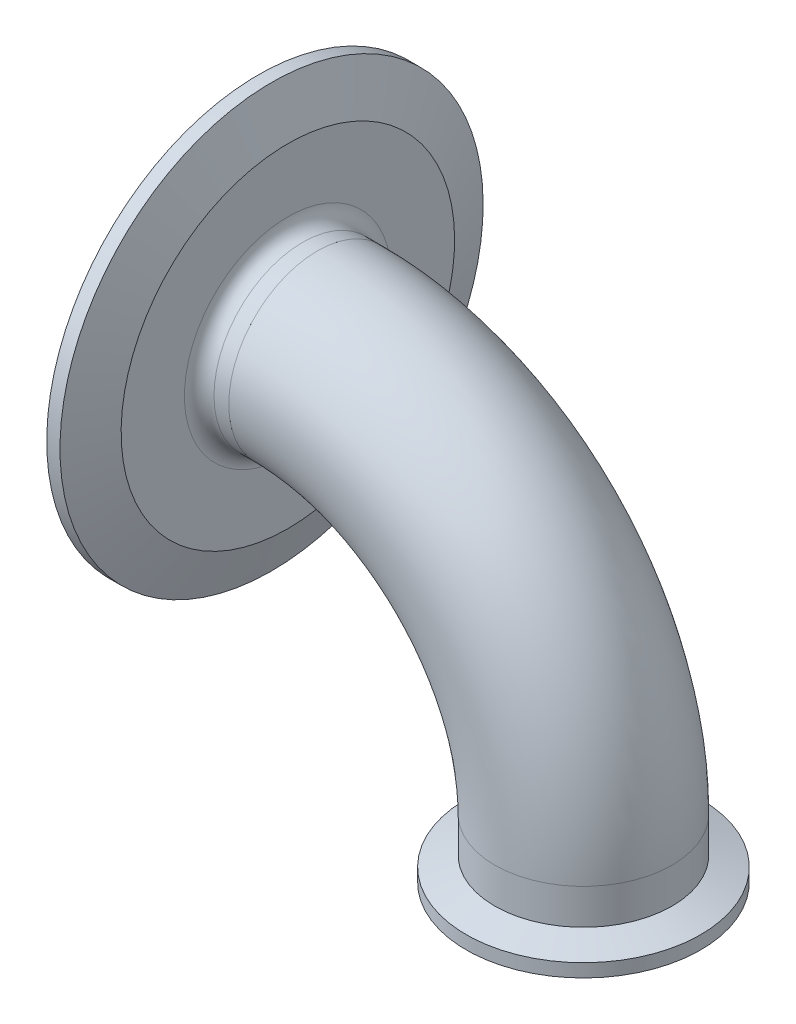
ISO-10303-21;
HEADER;
FILE_DESCRIPTION(('STEP AP214'),'2;1');
FILE_NAME('part.step','',(''),(''),'','','');
FILE_SCHEMA(('AUTOMOTIVE_DESIGN { 1 0 10303 214 1 1 1 1 }'));
ENDSEC;
DATA;
#1=APPLICATION_CONTEXT('core data for automotive mechanical design processes');
#2=APPLICATION_PROTOCOL_DEFINITION('international standard','automotive_design',2000,#1);
#3=PRODUCT_CONTEXT('',#1,'mechanical');
#4=PRODUCT('Part','Part','',(#3));
#5=PRODUCT_RELATED_PRODUCT_CATEGORY('part','',(#4));
#6=PRODUCT_DEFINITION_FORMATION('','',#4);
#7=PRODUCT_DEFINITION_CONTEXT('part definition',#1,'design');
#8=PRODUCT_DEFINITION('design','',#6,#7);
#9=PRODUCT_DEFINITION_SHAPE('','',#8);
#10=(LENGTH_UNIT() NAMED_UNIT(*) SI_UNIT(.MILLI.,.METRE.));
#11=(NAMED_UNIT(*) PLANE_ANGLE_UNIT() SI_UNIT($,.RADIAN.));
#12=(NAMED_UNIT(*) SI_UNIT($,.STERADIAN.) SOLID_ANGLE_UNIT());
#13=UNCERTAINTY_MEASURE_WITH_UNIT(LENGTH_MEASURE(1.E-05),#10,'distance_accuracy_value','');
#14=(GEOMETRIC_REPRESENTATION_CONTEXT(3) GLOBAL_UNCERTAINTY_ASSIGNED_CONTEXT((#13)) GLOBAL_UNIT_ASSIGNED_CONTEXT((#10,
#11,#12)) REPRESENTATION_CONTEXT('',''));
#15=CARTESIAN_POINT('',(0.,0.,0.));
#16=DIRECTION('',(0.,0.,1.));
#17=DIRECTION('',(1.,0.,0.));
#18=AXIS2_PLACEMENT_3D('',#15,#16,#17);
#19=CARTESIAN_POINT('',(59.5093319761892,14.6557046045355,81.3536655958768));
#20=DIRECTION('',(0.,1.00000000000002,0.));
#21=DIRECTION('',(0.,0.,1.00000000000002));
#22=AXIS2_PLACEMENT_3D('',#19,#20,#21);
#23=CONICAL_SURFACE('',#22,20.9336326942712,0.401425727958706);
#24=CARTESIAN_POINT('',(59.5093319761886,14.1359685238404,81.3536655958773));
#25=DIRECTION('',(0.,-1.00000000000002,0.));
#26=DIRECTION('',(0.,0.,-1.00000000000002));
#27=AXIS2_PLACEMENT_3D('',#24,#25,#26);
#28=CIRCLE('',#27,20.7130178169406);
#29=CARTESIAN_POINT('',(59.5093319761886,14.1359685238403,60.6406477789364));
#30=VERTEX_POINT('',#29);
#31=EDGE_CURVE('P0_E9',#30,#30,#28,.T.);
#32=ORIENTED_EDGE('',*,*,#31,.F.);
#33=EDGE_LOOP('',(#32));
#34=FACE_BOUND('',#33,.T.);
#35=CARTESIAN_POINT('',(59.5093319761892,14.6557046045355,81.3536655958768));
#36=DIRECTION('',(0.,-1.00000000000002,0.));
#37=DIRECTION('',(0.,0.,-1.00000000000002));
#38=AXIS2_PLACEMENT_3D('',#35,#36,#37);
#39=CIRCLE('',#38,20.9336326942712);
#40=CARTESIAN_POINT('',(59.5093319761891,14.6557046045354,60.4200329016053));
#41=VERTEX_POINT('',#40);
#42=EDGE_CURVE('P0_E54',#41,#41,#39,.T.);
#43=ORIENTED_EDGE('',*,*,#42,.T.);
#44=EDGE_LOOP('',(#43));
#45=FACE_BOUND('',#44,.T.);
#46=ADVANCED_FACE('P0_F14',(#34,#45),#23,.T.);
#47=CARTESIAN_POINT('',(59.5093319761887,14.4337056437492,81.3536655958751));
#48=DIRECTION('',(0.,-1.00000000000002,0.));
#49=DIRECTION('',(0.,0.,-1.00000000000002));
#50=AXIS2_PLACEMENT_3D('',#47,#48,#49);
#51=TOROIDAL_SURFACE('',#50,20.0115931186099,0.761999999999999);
#52=CARTESIAN_POINT('',(59.5093319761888,13.6717056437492,81.3536655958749));
#53=DIRECTION('',(0.,-1.00000000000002,0.));
#54=DIRECTION('',(0.,0.,-1.00000000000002));
#55=AXIS2_PLACEMENT_3D('',#52,#53,#54);
#56=CIRCLE('',#55,20.0115931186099);
#57=CARTESIAN_POINT('',(59.5093319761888,13.6717056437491,61.3420724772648));
#58=VERTEX_POINT('',#57);
#59=EDGE_CURVE('P0_E20',#58,#58,#56,.T.);
#60=ORIENTED_EDGE('',*,*,#59,.F.);
#61=EDGE_LOOP('',(#60));
#62=FACE_BOUND('',#61,.T.);
#63=ORIENTED_EDGE('',*,*,#31,.T.);
#64=EDGE_LOOP('',(#63));
#65=FACE_BOUND('',#64,.T.);
#66=ADVANCED_FACE('P0_F84',(#62,#65),#51,.T.);
#67=CARTESIAN_POINT('',(59.5093319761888,13.6717056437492,81.3536655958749));
#68=DIRECTION('',(0.,1.00000000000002,0.));
#69=DIRECTION('',(0.,0.,1.00000000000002));
#70=AXIS2_PLACEMENT_3D('',#67,#68,#69);
#71=PLANE('',#70);
#72=CARTESIAN_POINT('',(59.5093319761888,13.6717056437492,81.3536655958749));
#73=DIRECTION('',(0.,-1.00000000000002,0.));
#74=DIRECTION('',(0.,0.,-1.00000000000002));
#75=AXIS2_PLACEMENT_3D('',#72,#73,#74);
#76=CIRCLE('',#75,17.399);
#77=CARTESIAN_POINT('',(59.5093319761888,13.6717056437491,63.9546655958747));
#78=VERTEX_POINT('',#77);
#79=EDGE_CURVE('P0_E24',#78,#78,#76,.T.);
#80=ORIENTED_EDGE('',*,*,#79,.F.);
#81=EDGE_LOOP('',(#80));
#82=FACE_BOUND('',#81,.T.);
#83=ORIENTED_EDGE('',*,*,#59,.T.);
#84=EDGE_LOOP('',(#83));
#85=FACE_BOUND('',#84,.T.);
#86=ADVANCED_FACE('P0_F89',(#82,#85),#71,.F.);
#87=CARTESIAN_POINT('',(59.5093319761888,13.6717056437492,81.3536655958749));
#88=DIRECTION('',(0.,-1.00000000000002,0.));
#89=DIRECTION('',(0.,0.,-1.00000000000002));
#90=AXIS2_PLACEMENT_3D('',#87,#88,#89);
#91=CYLINDRICAL_SURFACE('',#90,17.399);
#92=ORIENTED_EDGE('',*,*,#79,.T.);
#93=EDGE_LOOP('',(#92));
#94=FACE_BOUND('',#93,.T.);
#95=CARTESIAN_POINT('',(59.5093319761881,26.3717056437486,81.3536655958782));
#96=DIRECTION('',(0.,-1.00000000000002,0.));
#97=DIRECTION('',(0.,0.,-1.00000000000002));
#98=AXIS2_PLACEMENT_3D('',#95,#96,#97);
#99=CIRCLE('',#98,17.399);
#100=CARTESIAN_POINT('',(59.5093319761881,26.3717056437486,63.954665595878));
#101=VERTEX_POINT('',#100);
#102=EDGE_CURVE('P0_E28',#101,#101,#99,.T.);
#103=ORIENTED_EDGE('',*,*,#102,.F.);
#104=EDGE_LOOP('',(#103));
#105=FACE_BOUND('',#104,.T.);
#106=ADVANCED_FACE('P0_F94',(#94,#105),#91,.F.);
#107=CARTESIAN_POINT('',(59.5093319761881,26.3717056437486,81.3536655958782));
#108=DIRECTION('',(0.,-1.00000000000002,0.));
#109=DIRECTION('',(0.,0.,-1.00000000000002));
#110=AXIS2_PLACEMENT_3D('',#107,#108,#109);
#111=PLANE('',#110);
#112=CARTESIAN_POINT('',(59.5093319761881,26.3717056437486,81.3536655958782));
#113=DIRECTION('',(0.,-1.00000000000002,0.));
#114=DIRECTION('',(0.,0.,-1.00000000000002));
#115=AXIS2_PLACEMENT_3D('',#112,#113,#114);
#116=CIRCLE('',#115,19.05);
#117=CARTESIAN_POINT('',(59.5093319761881,26.3717056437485,62.3036655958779));
#118=VERTEX_POINT('',#117);
#119=EDGE_CURVE('P0_E33',#118,#118,#116,.T.);
#120=ORIENTED_EDGE('',*,*,#119,.F.);
#121=EDGE_LOOP('',(#120));
#122=FACE_BOUND('',#121,.T.);
#123=ORIENTED_EDGE('',*,*,#102,.T.);
#124=EDGE_LOOP('',(#123));
#125=FACE_BOUND('',#124,.T.);
#126=ADVANCED_FACE('P0_F100',(#122,#125),#111,.F.);
#127=CARTESIAN_POINT('',(59.5093319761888,13.6717056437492,81.3536655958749));
#128=DIRECTION('',(0.,-1.00000000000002,0.));
#129=DIRECTION('',(0.,0.,-1.00000000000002));
#130=AXIS2_PLACEMENT_3D('',#127,#128,#129);
#131=CYLINDRICAL_SURFACE('',#130,19.05);
#132=CARTESIAN_POINT('',(59.5093319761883,18.7537578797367,81.3536655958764));
#133=DIRECTION('',(0.,-1.00000000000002,0.));
#134=DIRECTION('',(0.,0.,-1.00000000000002));
#135=AXIS2_PLACEMENT_3D('',#132,#133,#134);
#136=CIRCLE('',#135,19.05);
#137=CARTESIAN_POINT('',(59.5093319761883,18.7537578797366,62.3036655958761));
#138=VERTEX_POINT('',#137);
#139=EDGE_CURVE('P0_E36',#138,#138,#136,.T.);
#140=ORIENTED_EDGE('',*,*,#139,.F.);
#141=EDGE_LOOP('',(#140));
#142=FACE_BOUND('',#141,.T.);
#143=ORIENTED_EDGE('',*,*,#119,.T.);
#144=EDGE_LOOP('',(#143));
#145=FACE_BOUND('',#144,.T.);
#146=ADVANCED_FACE('P0_F104',(#142,#145),#131,.T.);
#147=CARTESIAN_POINT('',(59.5093319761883,18.7537578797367,81.3536655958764));
#148=DIRECTION('',(0.,-1.00000000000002,0.));
#149=DIRECTION('',(0.,0.,-1.00000000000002));
#150=AXIS2_PLACEMENT_3D('',#147,#148,#149);
#151=CONICAL_SURFACE('',#150,19.05,1.22173047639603);
#152=CARTESIAN_POINT('',(59.5093319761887,16.5165056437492,81.3536655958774));
#153=DIRECTION('',(0.,-1.00000000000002,0.));
#154=DIRECTION('',(0.,0.,-1.00000000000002));
#155=AXIS2_PLACEMENT_3D('',#152,#153,#154);
#156=CIRCLE('',#155,25.1968);
#157=CARTESIAN_POINT('',(59.5093319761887,16.5165056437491,56.156865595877));
#158=VERTEX_POINT('',#157);
#159=EDGE_CURVE('P0_E39',#158,#158,#156,.T.);
#160=ORIENTED_EDGE('',*,*,#159,.F.);
#161=EDGE_LOOP('',(#160));
#162=FACE_BOUND('',#161,.T.);
#163=ORIENTED_EDGE('',*,*,#139,.T.);
#164=EDGE_LOOP('',(#163));
#165=FACE_BOUND('',#164,.T.);
#166=ADVANCED_FACE('P0_F108',(#162,#165),#151,.T.);
#167=CARTESIAN_POINT('',(59.5093319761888,13.6717056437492,81.3536655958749));
#168=DIRECTION('',(0.,-1.00000000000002,0.));
#169=DIRECTION('',(0.,0.,-1.00000000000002));
#170=AXIS2_PLACEMENT_3D('',#167,#168,#169);
#171=CYLINDRICAL_SURFACE('',#170,25.1968);
#172=CARTESIAN_POINT('',(59.5093319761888,13.6717056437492,81.3536655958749));
#173=DIRECTION('',(0.,-1.00000000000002,0.));
#174=DIRECTION('',(0.,0.,-1.00000000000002));
#175=AXIS2_PLACEMENT_3D('',#172,#173,#174);
#176=CIRCLE('',#175,25.1968);
#177=CARTESIAN_POINT('',(59.5093319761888,13.6717056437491,56.1568655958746));
#178=VERTEX_POINT('',#177);
#179=EDGE_CURVE('P0_E42',#178,#178,#176,.T.);
#180=ORIENTED_EDGE('',*,*,#179,.F.);
#181=EDGE_LOOP('',(#180));
#182=FACE_BOUND('',#181,.T.);
#183=ORIENTED_EDGE('',*,*,#159,.T.);
#184=EDGE_LOOP('',(#183));
#185=FACE_BOUND('',#184,.T.);
#186=ADVANCED_FACE('P0_F80',(#182,#185),#171,.T.);
#187=CARTESIAN_POINT('',(59.5093319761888,13.6717056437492,81.3536655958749));
#188=DIRECTION('',(0.,1.00000000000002,0.));
#189=DIRECTION('',(0.,0.,1.00000000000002));
#190=AXIS2_PLACEMENT_3D('',#187,#188,#189);
#191=PLANE('',#190);
#192=CARTESIAN_POINT('',(59.5093319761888,13.6717056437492,81.3536655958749));
#193=DIRECTION('',(0.,-1.00000000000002,0.));
#194=DIRECTION('',(0.,0.,-1.00000000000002));
#195=AXIS2_PLACEMENT_3D('',#192,#193,#194);
#196=CIRCLE('',#195,23.9521599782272);
#197=CARTESIAN_POINT('',(59.5093319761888,13.6717056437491,57.4015056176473));
#198=VERTEX_POINT('',#197);
#199=EDGE_CURVE('P0_E45',#198,#198,#196,.T.);
#200=ORIENTED_EDGE('',*,*,#199,.F.);
#201=EDGE_LOOP('',(#200));
#202=FACE_BOUND('',#201,.T.);
#203=ORIENTED_EDGE('',*,*,#179,.T.);
#204=EDGE_LOOP('',(#203));
#205=FACE_BOUND('',#204,.T.);
#206=ADVANCED_FACE('P0_F73',(#202,#205),#191,.F.);
#207=CARTESIAN_POINT('',(59.5093319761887,14.4337056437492,81.3536655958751));
#208=DIRECTION('',(0.,-1.00000000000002,0.));
#209=DIRECTION('',(0.,0.,-1.00000000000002));
#210=AXIS2_PLACEMENT_3D('',#207,#208,#209);
#211=TOROIDAL_SURFACE('',#210,23.9521599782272,0.761999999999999);
#212=ORIENTED_EDGE('',*,*,#199,.T.);
#213=EDGE_LOOP('',(#212));
#214=FACE_BOUND('',#213,.T.);
#215=CARTESIAN_POINT('',(59.5093319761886,14.1359685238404,81.3536655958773));
#216=DIRECTION('',(0.,-1.00000000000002,0.));
#217=DIRECTION('',(0.,0.,-1.00000000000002));
#218=AXIS2_PLACEMENT_3D('',#215,#216,#217);
#219=CIRCLE('',#218,23.2507352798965);
#220=CARTESIAN_POINT('',(59.5093319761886,14.1359685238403,58.1029303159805));
#221=VERTEX_POINT('',#220);
#222=EDGE_CURVE('P0_E48',#221,#221,#219,.T.);
#223=ORIENTED_EDGE('',*,*,#222,.F.);
#224=EDGE_LOOP('',(#223));
#225=FACE_BOUND('',#224,.T.);
#226=ADVANCED_FACE('P0_F68',(#214,#225),#211,.T.);
#227=CARTESIAN_POINT('',(59.5093319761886,14.1359685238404,81.3536655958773));
#228=DIRECTION('',(0.,-1.00000000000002,0.));
#229=DIRECTION('',(0.,0.,-1.00000000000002));
#230=AXIS2_PLACEMENT_3D('',#227,#228,#229);
#231=CONICAL_SURFACE('',#230,23.2507352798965,0.401425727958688);
#232=CARTESIAN_POINT('',(59.5093319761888,14.5445604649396,81.3536655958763));
#233=DIRECTION('',(0.,-1.00000000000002,0.));
#234=DIRECTION('',(0.,0.,-1.00000000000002));
#235=AXIS2_PLACEMENT_3D('',#232,#233,#234);
#236=CIRCLE('',#235,23.0772982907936);
#237=CARTESIAN_POINT('',(59.5093319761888,14.5445604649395,58.2763673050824));
#238=VERTEX_POINT('',#237);
#239=EDGE_CURVE('P0_E51',#238,#238,#236,.T.);
#240=ORIENTED_EDGE('',*,*,#239,.F.);
#241=EDGE_LOOP('',(#240));
#242=FACE_BOUND('',#241,.T.);
#243=ORIENTED_EDGE('',*,*,#222,.T.);
#244=EDGE_LOOP('',(#243));
#245=FACE_BOUND('',#244,.T.);
#246=ADVANCED_FACE('P0_F62',(#242,#245),#231,.F.);
#247=CARTESIAN_POINT('',(59.5093319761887,14.0781056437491,81.353665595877));
#248=DIRECTION('',(0.,-1.00000000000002,0.));
#249=DIRECTION('',(0.,0.,-1.00000000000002));
#250=AXIS2_PLACEMENT_3D('',#247,#248,#249);
#251=TOROIDAL_SURFACE('',#250,21.9783995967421,1.1938);
#252=ORIENTED_EDGE('',*,*,#42,.F.);
#253=EDGE_LOOP('',(#252));
#254=FACE_BOUND('',#253,.T.);
#255=ORIENTED_EDGE('',*,*,#239,.T.);
#256=EDGE_LOOP('',(#255));
#257=FACE_BOUND('',#256,.T.);
#258=ADVANCED_FACE('P0_F59',(#254,#257),#251,.F.);
#259=CLOSED_SHELL('',(#46,#66,#86,#106,#126,#146,#166,#186,#206,#226,#246,#258));
#260=MANIFOLD_SOLID_BREP('P0_B1',#259);
#261=CARTESIAN_POINT('',(2.35933197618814,26.37170564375,81.3536655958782));
#262=DIRECTION('',(0.,0.,-1.));
#263=DIRECTION('',(-1.,0.,0.));
#264=AXIS2_PLACEMENT_3D('',#261,#262,#263);
#265=TOROIDAL_SURFACE('',#264,57.15,19.05);
#266=CARTESIAN_POINT('',(2.359331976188,83.5217056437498,81.3536655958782));
#267=DIRECTION('',(-1.,0.,0.));
#268=DIRECTION('',(0.,0.,1.));
#269=AXIS2_PLACEMENT_3D('',#266,#267,#268);
#270=CIRCLE('',#269,19.05);
#271=CARTESIAN_POINT('',(2.35933197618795,102.57170564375,81.3536655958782));
#272=VERTEX_POINT('',#271);
#273=EDGE_CURVE('P1_E10',#272,#272,#270,.T.);
#274=CARTESIAN_POINT('',(59.5093319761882,26.3717056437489,81.3536655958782));
#275=DIRECTION('',(0.,1.,0.));
#276=DIRECTION('',(0.,0.,1.));
#277=AXIS2_PLACEMENT_3D('',#274,#275,#276);
#278=CIRCLE('',#277,19.05);
#279=CARTESIAN_POINT('',(78.5593319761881,26.3717056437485,81.3536655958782));
#280=VERTEX_POINT('',#279);
#281=EDGE_CURVE('P1_E21',#280,#280,#278,.T.);
#282=CARTESIAN_POINT('',(2.35933197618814,26.37170564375,81.3536655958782));
#283=DIRECTION('',(0.,0.,-1.));
#284=DIRECTION('',(-1.,0.,0.));
#285=AXIS2_PLACEMENT_3D('',#282,#283,#284);
#286=CIRCLE('',#285,76.2);
#287=EDGE_CURVE('',#272,#280,#286,.T.);
#288=ORIENTED_EDGE('',*,*,#273,.F.);
#289=ORIENTED_EDGE('',*,*,#281,.T.);
#290=ORIENTED_EDGE('',*,*,#287,.T.);
#291=ORIENTED_EDGE('',*,*,#287,.F.);
#292=EDGE_LOOP('',(#288,#290,#289,#291));
#293=FACE_BOUND('',#292,.T.);
#294=ADVANCED_FACE('P1_F15',(#293),#265,.T.);
#295=CARTESIAN_POINT('',(2.359331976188,83.5217056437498,81.3536655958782));
#296=DIRECTION('',(-1.,0.,0.));
#297=DIRECTION('',(0.,0.,1.));
#298=AXIS2_PLACEMENT_3D('',#295,#296,#297);
#299=PLANE('',#298);
#300=CARTESIAN_POINT('',(2.359331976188,83.5217056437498,81.3536655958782));
#301=DIRECTION('',(-1.,0.,0.));
#302=DIRECTION('',(0.,-1.,0.));
#303=AXIS2_PLACEMENT_3D('',#300,#301,#302);
#304=CIRCLE('',#303,17.399);
#305=CARTESIAN_POINT('',(2.35933197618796,100.92070564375,81.3536655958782));
#306=VERTEX_POINT('',#305);
#307=EDGE_CURVE('P1_E25',#306,#306,#304,.T.);
#308=ORIENTED_EDGE('',*,*,#307,.F.);
#309=EDGE_LOOP('',(#308));
#310=FACE_BOUND('',#309,.T.);
#311=ORIENTED_EDGE('',*,*,#273,.T.);
#312=EDGE_LOOP('',(#311));
#313=FACE_BOUND('',#312,.T.);
#314=ADVANCED_FACE('P1_F46',(#310,#313),#299,.T.);
#315=CARTESIAN_POINT('',(59.5093319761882,26.3717056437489,81.3536655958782));
#316=DIRECTION('',(0.,1.,0.));
#317=DIRECTION('',(0.,0.,1.));
#318=AXIS2_PLACEMENT_3D('',#315,#316,#317);
#319=PLANE('',#318);
#320=CARTESIAN_POINT('',(59.5093319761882,26.3717056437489,81.3536655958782));
#321=DIRECTION('',(0.,1.,0.));
#322=DIRECTION('',(0.,0.,1.));
#323=AXIS2_PLACEMENT_3D('',#320,#321,#322);
#324=CIRCLE('',#323,17.399);
#325=CARTESIAN_POINT('',(76.9083319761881,26.3717056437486,81.3536655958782));
#326=VERTEX_POINT('',#325);
#327=EDGE_CURVE('P1_E29',#326,#326,#324,.T.);
#328=ORIENTED_EDGE('',*,*,#327,.T.);
#329=EDGE_LOOP('',(#328));
#330=FACE_BOUND('',#329,.T.);
#331=ORIENTED_EDGE('',*,*,#281,.F.);
#332=EDGE_LOOP('',(#331));
#333=FACE_BOUND('',#332,.T.);
#334=ADVANCED_FACE('P1_F35',(#330,#333),#319,.F.);
#335=CARTESIAN_POINT('',(2.35933197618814,26.37170564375,81.3536655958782));
#336=DIRECTION('',(0.,0.,-1.));
#337=DIRECTION('',(-1.,0.,0.));
#338=AXIS2_PLACEMENT_3D('',#335,#336,#337);
#339=TOROIDAL_SURFACE('',#338,57.15,17.399);
#340=CARTESIAN_POINT('',(2.35933197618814,26.37170564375,81.3536655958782));
#341=DIRECTION('',(0.,0.,-1.));
#342=DIRECTION('',(-1.,0.,0.));
#343=AXIS2_PLACEMENT_3D('',#340,#341,#342);
#344=CIRCLE('',#343,74.549);
#345=EDGE_CURVE('',#306,#326,#344,.T.);
#346=ORIENTED_EDGE('',*,*,#307,.T.);
#347=ORIENTED_EDGE('',*,*,#327,.F.);
#348=ORIENTED_EDGE('',*,*,#345,.T.);
#349=ORIENTED_EDGE('',*,*,#345,.F.);
#350=EDGE_LOOP('',(#346,#348,#347,#349));
#351=FACE_BOUND('',#350,.T.);
#352=ADVANCED_FACE('P1_F38',(#351),#339,.F.);
#353=CLOSED_SHELL('',(#294,#314,#334,#352));
#354=MANIFOLD_SOLID_BREP('P1_B1',#353);
#355=CARTESIAN_POINT('',(2.359331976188,96.5105696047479,92.9301337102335));
#356=DIRECTION('',(-1.,0.,0.));
#357=DIRECTION('',(0.,0.665352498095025,-0.746529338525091));
#358=AXIS2_PLACEMENT_3D('',#355,#356,#357);
#359=PLANE('',#358);
#360=CARTESIAN_POINT('',(2.35933197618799,83.5217056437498,81.3536655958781));
#361=DIRECTION('',(-1.,0.,0.));
#362=DIRECTION('',(0.,0.665352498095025,-0.746529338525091));
#363=AXIS2_PLACEMENT_3D('',#360,#361,#362);
#364=CIRCLE('',#363,19.05);
#365=CARTESIAN_POINT('',(2.35933197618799,96.19667073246,67.1322816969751));
#366=VERTEX_POINT('',#365);
#367=EDGE_CURVE('P2_E10',#366,#366,#364,.T.);
#368=ORIENTED_EDGE('',*,*,#367,.F.);
#369=EDGE_LOOP('',(#368));
#370=FACE_BOUND('',#369,.T.);
#371=CARTESIAN_POINT('',(2.359331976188,83.5217056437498,81.3536655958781));
#372=DIRECTION('',(-1.,0.,0.));
#373=DIRECTION('',(0.,0.665352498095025,-0.746529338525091));
#374=AXIS2_PLACEMENT_3D('',#371,#372,#373);
#375=CIRCLE('',#374,17.399);
#376=CARTESIAN_POINT('',(2.359331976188,95.0981737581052,68.3648016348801));
#377=VERTEX_POINT('',#376);
#378=EDGE_CURVE('P2_E64',#377,#377,#375,.T.);
#379=ORIENTED_EDGE('',*,*,#378,.T.);
#380=EDGE_LOOP('',(#379));
#381=FACE_BOUND('',#380,.T.);
#382=ADVANCED_FACE('P2_F15',(#370,#381),#359,.F.);
#383=CARTESIAN_POINT('',(-10.340668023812,83.5217056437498,81.3536655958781));
#384=DIRECTION('',(-1.,0.,0.));
#385=DIRECTION('',(0.,0.665352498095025,-0.746529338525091));
#386=AXIS2_PLACEMENT_3D('',#383,#384,#385);
#387=CYLINDRICAL_SURFACE('',#386,19.05);
#388=CARTESIAN_POINT('',(-0.815668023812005,83.5217056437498,81.3536655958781));
#389=DIRECTION('',(-1.,0.,0.));
#390=DIRECTION('',(0.,0.665352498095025,-0.746529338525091));
#391=AXIS2_PLACEMENT_3D('',#388,#389,#390);
#392=CIRCLE('',#391,19.05);
#393=CARTESIAN_POINT('',(-0.815668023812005,96.19667073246,67.1322816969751));
#394=VERTEX_POINT('',#393);
#395=EDGE_CURVE('P2_E21',#394,#394,#392,.T.);
#396=ORIENTED_EDGE('',*,*,#395,.F.);
#397=EDGE_LOOP('',(#396));
#398=FACE_BOUND('',#397,.T.);
#399=ORIENTED_EDGE('',*,*,#367,.T.);
#400=EDGE_LOOP('',(#399));
#401=FACE_BOUND('',#400,.T.);
#402=ADVANCED_FACE('P2_F143',(#398,#401),#387,.T.);
#403=CARTESIAN_POINT('',(-0.815668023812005,83.5217056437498,81.3536655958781));
#404=DIRECTION('',(-1.,0.,0.));
#405=DIRECTION('',(0.,0.665352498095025,-0.746529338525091));
#406=AXIS2_PLACEMENT_3D('',#403,#404,#405);
#407=TOROIDAL_SURFACE('',#406,22.225,3.175);
#408=CARTESIAN_POINT('',(-3.99066802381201,83.5217056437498,81.3536655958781));
#409=DIRECTION('',(-1.,0.,0.));
#410=DIRECTION('',(0.,0.665352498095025,-0.746529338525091));
#411=AXIS2_PLACEMENT_3D('',#408,#409,#410);
#412=CIRCLE('',#411,22.225);
#413=CARTESIAN_POINT('',(-3.99066802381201,98.3091649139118,64.762051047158));
#414=VERTEX_POINT('',#413);
#415=EDGE_CURVE('P2_E25',#414,#414,#412,.T.);
#416=ORIENTED_EDGE('',*,*,#415,.F.);
#417=EDGE_LOOP('',(#416));
#418=FACE_BOUND('',#417,.T.);
#419=ORIENTED_EDGE('',*,*,#395,.T.);
#420=EDGE_LOOP('',(#419));
#421=FACE_BOUND('',#420,.T.);
#422=ADVANCED_FACE('P2_F138',(#418,#421),#407,.F.);
#423=CARTESIAN_POINT('',(-3.990668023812,100.11332019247,96.1411248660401));
#424=DIRECTION('',(-1.,0.,0.));
#425=DIRECTION('',(0.,0.665352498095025,-0.746529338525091));
#426=AXIS2_PLACEMENT_3D('',#423,#424,#425);
#427=PLANE('',#426);
#428=CARTESIAN_POINT('',(-3.990668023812,83.5217056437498,81.3536655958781));
#429=DIRECTION('',(-1.,0.,0.));
#430=DIRECTION('',(0.,0.665352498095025,-0.746529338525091));
#431=AXIS2_PLACEMENT_3D('',#428,#429,#430);
#432=CIRCLE('',#431,35.8228421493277);
#433=CARTESIAN_POINT('',(-3.990668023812,107.356523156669,54.6108629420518));
#434=VERTEX_POINT('',#433);
#435=EDGE_CURVE('P2_E29',#434,#434,#432,.T.);
#436=ORIENTED_EDGE('',*,*,#435,.F.);
#437=EDGE_LOOP('',(#436));
#438=FACE_BOUND('',#437,.T.);
#439=ORIENTED_EDGE('',*,*,#415,.T.);
#440=EDGE_LOOP('',(#439));
#441=FACE_BOUND('',#440,.T.);
#442=ADVANCED_FACE('P2_F132',(#438,#441),#427,.F.);
#443=CARTESIAN_POINT('',(-3.990668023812,83.5217056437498,81.3536655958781));
#444=DIRECTION('',(-1.,0.,0.));
#445=DIRECTION('',(0.,0.665352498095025,-0.746529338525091));
#446=AXIS2_PLACEMENT_3D('',#443,#444,#445);
#447=CONICAL_SURFACE('',#446,35.8228421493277,1.22173047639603);
#448=CARTESIAN_POINT('',(-7.495868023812,83.5217056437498,81.3536655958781));
#449=DIRECTION('',(-1.,0.,0.));
#450=DIRECTION('',(0.,0.665352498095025,-0.746529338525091));
#451=AXIS2_PLACEMENT_3D('',#448,#449,#450);
#452=CIRCLE('',#451,45.4533);
#453=CARTESIAN_POINT('',(-7.495868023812,113.764172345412,47.4214436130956));
#454=VERTEX_POINT('',#453);
#455=EDGE_CURVE('P2_E34',#454,#454,#452,.T.);
#456=ORIENTED_EDGE('',*,*,#455,.F.);
#457=EDGE_LOOP('',(#456));
#458=FACE_BOUND('',#457,.T.);
#459=ORIENTED_EDGE('',*,*,#435,.T.);
#460=EDGE_LOOP('',(#459));
#461=FACE_BOUND('',#460,.T.);
#462=ADVANCED_FACE('P2_F126',(#458,#461),#447,.T.);
#463=CARTESIAN_POINT('',(-10.340668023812,83.5217056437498,81.3536655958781));
#464=DIRECTION('',(-1.,0.,0.));
#465=DIRECTION('',(0.,0.665352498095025,-0.746529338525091));
#466=AXIS2_PLACEMENT_3D('',#463,#464,#465);
#467=CYLINDRICAL_SURFACE('',#466,45.4533);
#468=CARTESIAN_POINT('',(-10.340668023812,83.5217056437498,81.3536655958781));
#469=DIRECTION('',(-1.,0.,0.));
#470=DIRECTION('',(0.,0.665352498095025,-0.746529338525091));
#471=AXIS2_PLACEMENT_3D('',#468,#469,#470);
#472=CIRCLE('',#471,45.4533);
#473=CARTESIAN_POINT('',(-10.340668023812,113.764172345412,47.4214436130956));
#474=VERTEX_POINT('',#473);
#475=EDGE_CURVE('P2_E37',#474,#474,#472,.T.);
#476=ORIENTED_EDGE('',*,*,#475,.F.);
#477=EDGE_LOOP('',(#476));
#478=FACE_BOUND('',#477,.T.);
#479=ORIENTED_EDGE('',*,*,#455,.T.);
#480=EDGE_LOOP('',(#479));
#481=FACE_BOUND('',#480,.T.);
#482=ADVANCED_FACE('P2_F120',(#478,#481),#467,.T.);
#483=CARTESIAN_POINT('',(-10.340668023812,83.5217056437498,81.3536655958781));
#484=DIRECTION('',(-1.,0.,0.));
#485=DIRECTION('',(0.,0.665352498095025,-0.746529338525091));
#486=AXIS2_PLACEMENT_3D('',#483,#484,#485);
#487=CONICAL_SURFACE('',#486,45.4533,1.56939586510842);
#488=CARTESIAN_POINT('',(-10.3381555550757,83.5217056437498,81.3536655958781));
#489=DIRECTION('',(-1.,0.,0.));
#490=DIRECTION('',(0.,0.665352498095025,-0.746529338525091));
#491=AXIS2_PLACEMENT_3D('',#488,#489,#490);
#492=CIRCLE('',#491,43.6592722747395);
#493=CARTESIAN_POINT('',(-10.3381555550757,112.570511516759,48.76073794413));
#494=VERTEX_POINT('',#493);
#495=EDGE_CURVE('P2_E40',#494,#494,#492,.T.);
#496=ORIENTED_EDGE('',*,*,#495,.F.);
#497=EDGE_LOOP('',(#496));
#498=FACE_BOUND('',#497,.T.);
#499=ORIENTED_EDGE('',*,*,#475,.T.);
#500=EDGE_LOOP('',(#499));
#501=FACE_BOUND('',#500,.T.);
#502=ADVANCED_FACE('P2_F114',(#498,#501),#487,.F.);
#503=CARTESIAN_POINT('',(-9.55075555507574,83.5217056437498,81.3536655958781));
#504=DIRECTION('',(-1.,0.,0.));
#505=DIRECTION('',(0.,0.665352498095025,-0.746529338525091));
#506=AXIS2_PLACEMENT_3D('',#503,#504,#505);
#507=TOROIDAL_SURFACE('',#506,43.6592722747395,0.787399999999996);
#508=CARTESIAN_POINT('',(-9.85841724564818,83.5217056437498,81.3536655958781));
#509=DIRECTION('',(-1.,0.,0.));
#510=DIRECTION('',(0.,0.665352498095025,-0.746529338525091));
#511=AXIS2_PLACEMENT_3D('',#508,#509,#510);
#512=CIRCLE('',#511,42.9344667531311);
#513=CARTESIAN_POINT('',(-9.85841724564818,112.088260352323,49.3018265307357));
#514=VERTEX_POINT('',#513);
#515=EDGE_CURVE('P2_E43',#514,#514,#512,.T.);
#516=ORIENTED_EDGE('',*,*,#515,.F.);
#517=EDGE_LOOP('',(#516));
#518=FACE_BOUND('',#517,.T.);
#519=ORIENTED_EDGE('',*,*,#495,.T.);
#520=EDGE_LOOP('',(#519));
#521=FACE_BOUND('',#520,.T.);
#522=ADVANCED_FACE('P2_F108',(#518,#521),#507,.T.);
#523=CARTESIAN_POINT('',(-9.85841724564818,83.5217056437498,81.3536655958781));
#524=DIRECTION('',(-1.,0.,0.));
#525=DIRECTION('',(0.,0.665352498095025,-0.746529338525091));
#526=AXIS2_PLACEMENT_3D('',#523,#524,#525);
#527=CONICAL_SURFACE('',#526,42.9344667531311,0.401425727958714);
#528=CARTESIAN_POINT('',(-9.46530073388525,83.5217056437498,81.3536655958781));
#529=DIRECTION('',(-1.,0.,0.));
#530=DIRECTION('',(0.,0.665352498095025,-0.746529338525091));
#531=AXIS2_PLACEMENT_3D('',#528,#529,#530);
#532=CIRCLE('',#531,42.7675986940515);
#533=CARTESIAN_POINT('',(-9.46530073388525,111.977234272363,49.4263984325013));
#534=VERTEX_POINT('',#533);
#535=EDGE_CURVE('P2_E46',#534,#534,#532,.T.);
#536=ORIENTED_EDGE('',*,*,#535,.F.);
#537=EDGE_LOOP('',(#536));
#538=FACE_BOUND('',#537,.T.);
#539=ORIENTED_EDGE('',*,*,#515,.T.);
#540=EDGE_LOOP('',(#539));
#541=FACE_BOUND('',#540,.T.);
#542=ADVANCED_FACE('P2_F102',(#538,#541),#527,.F.);
#543=CARTESIAN_POINT('',(-9.93175555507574,83.5217056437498,81.3536655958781));
#544=DIRECTION('',(-1.,0.,0.));
#545=DIRECTION('',(0.,0.665352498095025,-0.746529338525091));
#546=AXIS2_PLACEMENT_3D('',#543,#544,#545);
#547=TOROIDAL_SURFACE('',#546,41.6687,1.19379999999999);
#548=CARTESIAN_POINT('',(-9.46530073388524,83.5217056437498,81.3536655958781));
#549=DIRECTION('',(-1.,0.,0.));
#550=DIRECTION('',(0.,0.665352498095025,-0.746529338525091));
#551=AXIS2_PLACEMENT_3D('',#548,#549,#550);
#552=CIRCLE('',#551,40.5698013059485);
#553=CARTESIAN_POINT('',(-9.46530073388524,110.514924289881,51.067118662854));
#554=VERTEX_POINT('',#553);
#555=EDGE_CURVE('P2_E49',#554,#554,#552,.T.);
#556=ORIENTED_EDGE('',*,*,#555,.F.);
#557=EDGE_LOOP('',(#556));
#558=FACE_BOUND('',#557,.T.);
#559=ORIENTED_EDGE('',*,*,#535,.T.);
#560=EDGE_LOOP('',(#559));
#561=FACE_BOUND('',#560,.T.);
#562=ADVANCED_FACE('P2_F96',(#558,#561),#547,.F.);
#563=CARTESIAN_POINT('',(-9.46530073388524,83.5217056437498,81.3536655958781));
#564=DIRECTION('',(1.,0.,0.));
#565=DIRECTION('',(0.,-0.665352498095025,0.746529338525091));
#566=AXIS2_PLACEMENT_3D('',#563,#564,#565);
#567=CONICAL_SURFACE('',#566,40.5698013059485,0.401425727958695);
#568=CARTESIAN_POINT('',(-9.85841724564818,83.5217056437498,81.3536655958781));
#569=DIRECTION('',(-1.,0.,0.));
#570=DIRECTION('',(0.,0.665352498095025,-0.746529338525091));
#571=AXIS2_PLACEMENT_3D('',#568,#569,#570);
#572=CIRCLE('',#571,40.402933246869);
#573=CARTESIAN_POINT('',(-9.85841724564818,110.403898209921,51.1916905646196));
#574=VERTEX_POINT('',#573);
#575=EDGE_CURVE('P2_E52',#574,#574,#572,.T.);
#576=ORIENTED_EDGE('',*,*,#575,.F.);
#577=EDGE_LOOP('',(#576));
#578=FACE_BOUND('',#577,.T.);
#579=ORIENTED_EDGE('',*,*,#555,.T.);
#580=EDGE_LOOP('',(#579));
#581=FACE_BOUND('',#580,.T.);
#582=ADVANCED_FACE('P2_F90',(#578,#581),#567,.T.);
#583=CARTESIAN_POINT('',(-9.55075555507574,83.5217056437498,81.3536655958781));
#584=DIRECTION('',(-1.,0.,0.));
#585=DIRECTION('',(0.,0.665352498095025,-0.746529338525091));
#586=AXIS2_PLACEMENT_3D('',#583,#584,#585);
#587=TOROIDAL_SURFACE('',#586,39.6781277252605,0.787399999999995);
#588=CARTESIAN_POINT('',(-10.3381555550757,83.5217056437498,81.3536655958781));
#589=DIRECTION('',(-1.,0.,0.));
#590=DIRECTION('',(0.,0.665352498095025,-0.746529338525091));
#591=AXIS2_PLACEMENT_3D('',#588,#589,#590);
#592=CIRCLE('',#591,39.6781277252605);
#593=CARTESIAN_POINT('',(-10.3381555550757,109.921647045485,51.7327791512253));
#594=VERTEX_POINT('',#593);
#595=EDGE_CURVE('P2_E55',#594,#594,#592,.T.);
#596=ORIENTED_EDGE('',*,*,#595,.F.);
#597=EDGE_LOOP('',(#596));
#598=FACE_BOUND('',#597,.T.);
#599=ORIENTED_EDGE('',*,*,#575,.T.);
#600=EDGE_LOOP('',(#599));
#601=FACE_BOUND('',#600,.T.);
#602=ADVANCED_FACE('P2_F84',(#598,#601),#587,.T.);
#603=CARTESIAN_POINT('',(-10.3381555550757,83.5217056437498,81.3536655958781));
#604=DIRECTION('',(1.,0.,0.));
#605=DIRECTION('',(0.,-0.665352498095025,0.746529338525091));
#606=AXIS2_PLACEMENT_3D('',#603,#604,#605);
#607=CONICAL_SURFACE('',#606,39.6781277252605,1.57001826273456);
#608=CARTESIAN_POINT('',(-10.340668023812,83.5217056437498,81.3536655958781));
#609=DIRECTION('',(-1.,0.,0.));
#610=DIRECTION('',(0.,0.665352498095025,-0.746529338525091));
#611=AXIS2_PLACEMENT_3D('',#608,#609,#610);
#612=CIRCLE('',#611,36.449);
#613=CARTESIAN_POINT('',(-10.340668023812,107.773138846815,54.1434177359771));
#614=VERTEX_POINT('',#613);
#615=EDGE_CURVE('P2_E58',#614,#614,#612,.T.);
#616=ORIENTED_EDGE('',*,*,#615,.F.);
#617=EDGE_LOOP('',(#616));
#618=FACE_BOUND('',#617,.T.);
#619=ORIENTED_EDGE('',*,*,#595,.T.);
#620=EDGE_LOOP('',(#619));
#621=FACE_BOUND('',#620,.T.);
#622=ADVANCED_FACE('P2_F78',(#618,#621),#607,.T.);
#623=CARTESIAN_POINT('',(-10.340668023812,83.5217056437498,81.3536655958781));
#624=DIRECTION('',(-1.,0.,0.));
#625=DIRECTION('',(0.,0.665352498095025,-0.746529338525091));
#626=AXIS2_PLACEMENT_3D('',#623,#624,#625);
#627=CONICAL_SURFACE('',#626,36.449,1.26710903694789);
#628=CARTESIAN_POINT('',(-4.37075989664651,83.5217056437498,81.3536655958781));
#629=DIRECTION('',(-1.,0.,0.));
#630=DIRECTION('',(0.,0.665352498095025,-0.746529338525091));
#631=AXIS2_PLACEMENT_3D('',#628,#629,#630);
#632=CIRCLE('',#631,17.399);
#633=CARTESIAN_POINT('',(-4.37075989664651,95.0981737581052,68.3648016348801));
#634=VERTEX_POINT('',#633);
#635=EDGE_CURVE('P2_E61',#634,#634,#632,.T.);
#636=ORIENTED_EDGE('',*,*,#635,.F.);
#637=EDGE_LOOP('',(#636));
#638=FACE_BOUND('',#637,.T.);
#639=ORIENTED_EDGE('',*,*,#615,.T.);
#640=EDGE_LOOP('',(#639));
#641=FACE_BOUND('',#640,.T.);
#642=ADVANCED_FACE('P2_F72',(#638,#641),#627,.F.);
#643=CARTESIAN_POINT('',(-10.340668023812,83.5217056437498,81.3536655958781));
#644=DIRECTION('',(-1.,0.,0.));
#645=DIRECTION('',(0.,0.665352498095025,-0.746529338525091));
#646=AXIS2_PLACEMENT_3D('',#643,#644,#645);
#647=CYLINDRICAL_SURFACE('',#646,17.399);
#648=ORIENTED_EDGE('',*,*,#378,.F.);
#649=EDGE_LOOP('',(#648));
#650=FACE_BOUND('',#649,.T.);
#651=ORIENTED_EDGE('',*,*,#635,.T.);
#652=EDGE_LOOP('',(#651));
#653=FACE_BOUND('',#652,.T.);
#654=ADVANCED_FACE('P2_F69',(#650,#653),#647,.F.);
#655=CLOSED_SHELL('',(#382,#402,#422,#442,#462,#482,#502,#522,#542,#562,#582,#602,#622,#642,#654));
#656=MANIFOLD_SOLID_BREP('P2_B1',#655);
#657=ADVANCED_BREP_SHAPE_REPRESENTATION('',(#18,#260,#354,#656),#14);
#658=SHAPE_DEFINITION_REPRESENTATION(#9,#657);
ENDSEC;
END-ISO-10303-21;
